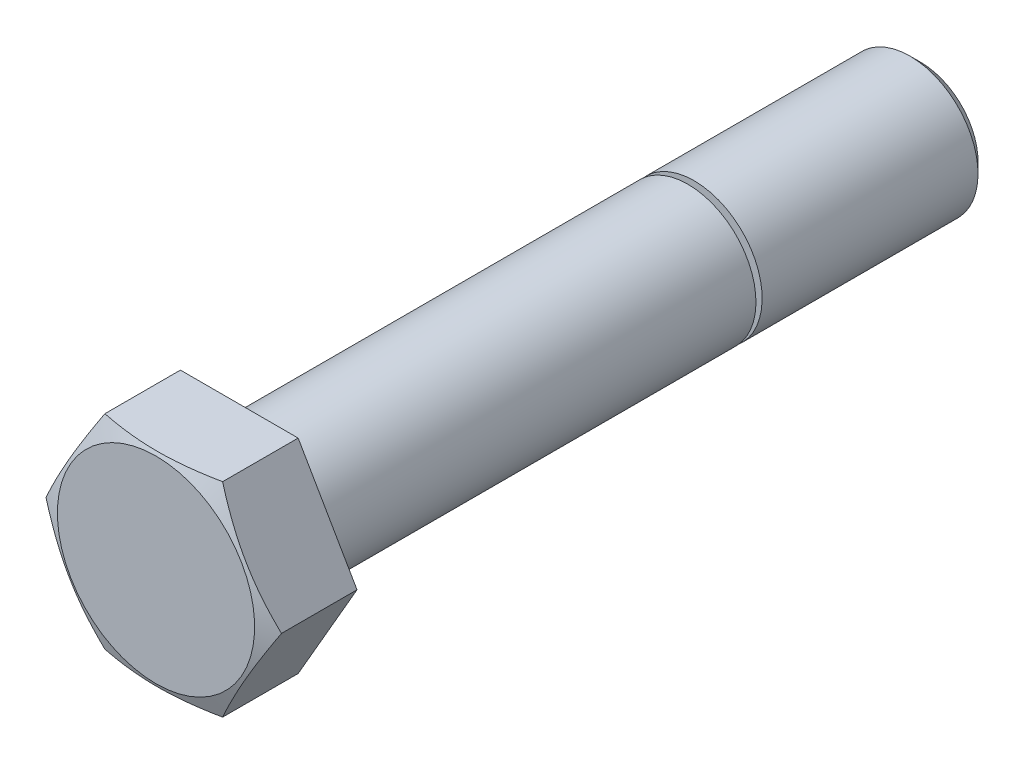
ISO-10303-21;
HEADER;
FILE_DESCRIPTION(('STEP AP214'),'2;1');
FILE_NAME('part.step','',(''),(''),'','','');
FILE_SCHEMA(('AUTOMOTIVE_DESIGN { 1 0 10303 214 1 1 1 1 }'));
ENDSEC;
DATA;
#1=APPLICATION_CONTEXT('core data for automotive mechanical design processes');
#2=APPLICATION_PROTOCOL_DEFINITION('international standard','automotive_design',2000,#1);
#3=PRODUCT_CONTEXT('',#1,'mechanical');
#4=PRODUCT('Part','Part','',(#3));
#5=PRODUCT_RELATED_PRODUCT_CATEGORY('part','',(#4));
#6=PRODUCT_DEFINITION_FORMATION('','',#4);
#7=PRODUCT_DEFINITION_CONTEXT('part definition',#1,'design');
#8=PRODUCT_DEFINITION('design','',#6,#7);
#9=PRODUCT_DEFINITION_SHAPE('','',#8);
#10=(LENGTH_UNIT() NAMED_UNIT(*) SI_UNIT(.MILLI.,.METRE.));
#11=(NAMED_UNIT(*) PLANE_ANGLE_UNIT() SI_UNIT($,.RADIAN.));
#12=(NAMED_UNIT(*) SI_UNIT($,.STERADIAN.) SOLID_ANGLE_UNIT());
#13=UNCERTAINTY_MEASURE_WITH_UNIT(LENGTH_MEASURE(1.E-05),#10,'distance_accuracy_value','');
#14=(GEOMETRIC_REPRESENTATION_CONTEXT(3) GLOBAL_UNCERTAINTY_ASSIGNED_CONTEXT((#13)) GLOBAL_UNIT_ASSIGNED_CONTEXT((#10,
#11,#12)) REPRESENTATION_CONTEXT('',''));
#15=CARTESIAN_POINT('',(0.,0.,0.));
#16=DIRECTION('',(0.,0.,1.));
#17=DIRECTION('',(1.,0.,0.));
#18=AXIS2_PLACEMENT_3D('',#15,#16,#17);
#19=CARTESIAN_POINT('',(0.,2.52640625,-60.));
#20=DIRECTION('',(0.,0.,-1.));
#21=DIRECTION('',(0.,1.,0.));
#22=AXIS2_PLACEMENT_3D('',#19,#20,#21);
#23=PLANE('',#22);
#24=CARTESIAN_POINT('',(0.,0.,-60.));
#25=DIRECTION('',(0.,0.,-1.));
#26=DIRECTION('',(0.,1.,0.));
#27=AXIS2_PLACEMENT_3D('',#24,#25,#26);
#28=CIRCLE('',#27,5.0528125);
#29=CARTESIAN_POINT('',(0.,5.0528125,-60.));
#30=VERTEX_POINT('',#29);
#31=EDGE_CURVE('E12',#30,#30,#28,.T.);
#32=ORIENTED_EDGE('',*,*,#31,.T.);
#33=EDGE_LOOP('',(#32));
#34=FACE_BOUND('',#33,.T.);
#35=ADVANCED_FACE('F37',(#34),#23,.T.);
#36=CARTESIAN_POINT('',(0.,0.,-59.52640625));
#37=DIRECTION('',(0.,0.,1.));
#38=DIRECTION('',(0.,1.,0.));
#39=AXIS2_PLACEMENT_3D('',#36,#37,#38);
#40=CONICAL_SURFACE('',#39,5.52640625,0.785398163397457);
#41=CARTESIAN_POINT('',(0.,0.,-59.0528125));
#42=DIRECTION('',(0.,0.,-1.));
#43=DIRECTION('',(0.,1.,0.));
#44=AXIS2_PLACEMENT_3D('',#41,#42,#43);
#45=CIRCLE('',#44,6.);
#46=CARTESIAN_POINT('',(0.,6.,-59.0528125));
#47=VERTEX_POINT('',#46);
#48=EDGE_CURVE('E46',#47,#47,#45,.T.);
#49=ORIENTED_EDGE('',*,*,#48,.T.);
#50=EDGE_LOOP('',(#49));
#51=FACE_BOUND('',#50,.T.);
#52=ORIENTED_EDGE('',*,*,#31,.F.);
#53=EDGE_LOOP('',(#52));
#54=FACE_BOUND('',#53,.T.);
#55=ADVANCED_FACE('F222',(#51,#54),#40,.T.);
#56=CARTESIAN_POINT('',(0.,0.,-44.52640625));
#57=DIRECTION('',(0.,0.,1.));
#58=DIRECTION('',(0.,1.,0.));
#59=AXIS2_PLACEMENT_3D('',#56,#57,#58);
#60=CYLINDRICAL_SURFACE('',#59,6.);
#61=CARTESIAN_POINT('',(0.,0.,-40.));
#62=DIRECTION('',(0.,0.,1.));
#63=DIRECTION('',(1.,0.,0.));
#64=AXIS2_PLACEMENT_3D('',#61,#62,#63);
#65=CIRCLE('',#64,6.);
#66=CARTESIAN_POINT('',(0.,6.,-40.));
#67=VERTEX_POINT('',#66);
#68=EDGE_CURVE('E40',#67,#67,#65,.F.);
#69=ORIENTED_EDGE('',*,*,#68,.T.);
#70=EDGE_LOOP('',(#69));
#71=FACE_BOUND('',#70,.T.);
#72=ORIENTED_EDGE('',*,*,#48,.F.);
#73=EDGE_LOOP('',(#72));
#74=FACE_BOUND('',#73,.T.);
#75=ADVANCED_FACE('F206',(#71,#74),#60,.T.);
#76=CARTESIAN_POINT('',(0.,5.52640625,-40.));
#77=DIRECTION('',(0.,0.,1.));
#78=DIRECTION('',(0.,-1.,0.));
#79=AXIS2_PLACEMENT_3D('',#76,#77,#78);
#80=PLANE('',#79);
#81=CARTESIAN_POINT('',(0.,0.,-40.));
#82=DIRECTION('',(0.,0.,-1.));
#83=DIRECTION('',(0.,1.,0.));
#84=AXIS2_PLACEMENT_3D('',#81,#82,#83);
#85=CIRCLE('',#84,5.0528125);
#86=CARTESIAN_POINT('',(0.,5.0528125,-40.));
#87=VERTEX_POINT('',#86);
#88=EDGE_CURVE('E180',#87,#87,#85,.T.);
#89=ORIENTED_EDGE('',*,*,#88,.T.);
#90=EDGE_LOOP('',(#89));
#91=FACE_BOUND('',#90,.T.);
#92=ORIENTED_EDGE('',*,*,#68,.F.);
#93=EDGE_LOOP('',(#92));
#94=FACE_BOUND('',#93,.T.);
#95=ADVANCED_FACE('F209',(#91,#94),#80,.T.);
#96=CARTESIAN_POINT('',(0.,0.,-39.726570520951));
#97=DIRECTION('',(0.,0.,1.));
#98=DIRECTION('',(0.,1.,0.));
#99=AXIS2_PLACEMENT_3D('',#96,#97,#98);
#100=CONICAL_SURFACE('',#99,5.52640625,1.0471975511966);
#101=CARTESIAN_POINT('',(0.,0.,-39.4531410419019));
#102=DIRECTION('',(0.,0.,-1.));
#103=DIRECTION('',(0.,1.,0.));
#104=AXIS2_PLACEMENT_3D('',#101,#102,#103);
#105=CIRCLE('',#104,6.);
#106=CARTESIAN_POINT('',(0.,6.,-39.4531410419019));
#107=VERTEX_POINT('',#106);
#108=EDGE_CURVE('E149',#107,#107,#105,.T.);
#109=ORIENTED_EDGE('',*,*,#108,.T.);
#110=EDGE_LOOP('',(#109));
#111=FACE_BOUND('',#110,.T.);
#112=ORIENTED_EDGE('',*,*,#88,.F.);
#113=EDGE_LOOP('',(#112));
#114=FACE_BOUND('',#113,.T.);
#115=ADVANCED_FACE('F211',(#111,#114),#100,.T.);
#116=CARTESIAN_POINT('',(0.,0.,-20.026570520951));
#117=DIRECTION('',(0.,0.,1.));
#118=DIRECTION('',(0.,1.,0.));
#119=AXIS2_PLACEMENT_3D('',#116,#117,#118);
#120=CYLINDRICAL_SURFACE('',#119,6.);
#121=CARTESIAN_POINT('',(0.,0.,-0.6));
#122=DIRECTION('',(0.,0.,-1.));
#123=DIRECTION('',(0.,1.,0.));
#124=AXIS2_PLACEMENT_3D('',#121,#122,#123);
#125=CIRCLE('',#124,6.);
#126=CARTESIAN_POINT('',(0.,6.,-0.6));
#127=VERTEX_POINT('',#126);
#128=EDGE_CURVE('E118',#127,#127,#125,.T.);
#129=ORIENTED_EDGE('',*,*,#128,.T.);
#130=EDGE_LOOP('',(#129));
#131=FACE_BOUND('',#130,.T.);
#132=ORIENTED_EDGE('',*,*,#108,.F.);
#133=EDGE_LOOP('',(#132));
#134=FACE_BOUND('',#133,.T.);
#135=ADVANCED_FACE('F218',(#131,#134),#120,.T.);
#136=CARTESIAN_POINT('',(0.,0.,-0.6));
#137=DIRECTION('',(0.,0.,-1.));
#138=DIRECTION('',(-1.,0.,0.));
#139=AXIS2_PLACEMENT_3D('',#136,#137,#138);
#140=TOROIDAL_SURFACE('',#139,6.6,0.6);
#141=CARTESIAN_POINT('',(0.,0.,0.));
#142=DIRECTION('',(0.,0.,-1.));
#143=DIRECTION('',(0.,1.,0.));
#144=AXIS2_PLACEMENT_3D('',#141,#142,#143);
#145=CIRCLE('',#144,6.6);
#146=CARTESIAN_POINT('',(0.,6.6,0.));
#147=VERTEX_POINT('',#146);
#148=EDGE_CURVE('E115',#147,#147,#145,.T.);
#149=ORIENTED_EDGE('',*,*,#148,.T.);
#150=EDGE_LOOP('',(#149));
#151=FACE_BOUND('',#150,.T.);
#152=ORIENTED_EDGE('',*,*,#128,.F.);
#153=EDGE_LOOP('',(#152));
#154=FACE_BOUND('',#153,.T.);
#155=ADVANCED_FACE('F264',(#151,#154),#140,.F.);
#156=CARTESIAN_POINT('',(0.,7.4575,0.));
#157=DIRECTION('',(0.,0.,-1.));
#158=DIRECTION('',(0.,1.,0.));
#159=AXIS2_PLACEMENT_3D('',#156,#157,#158);
#160=PLANE('',#159);
#161=CARTESIAN_POINT('',(0.,0.,0.));
#162=DIRECTION('',(0.,0.,-1.));
#163=DIRECTION('',(0.,1.,0.));
#164=AXIS2_PLACEMENT_3D('',#161,#162,#163);
#165=CIRCLE('',#164,8.315);
#166=CARTESIAN_POINT('',(0.,8.315,0.));
#167=VERTEX_POINT('',#166);
#168=EDGE_CURVE('E111',#167,#167,#165,.T.);
#169=ORIENTED_EDGE('',*,*,#168,.T.);
#170=EDGE_LOOP('',(#169));
#171=FACE_BOUND('',#170,.T.);
#172=ORIENTED_EDGE('',*,*,#148,.F.);
#173=EDGE_LOOP('',(#172));
#174=FACE_BOUND('',#173,.T.);
#175=ADVANCED_FACE('F112',(#171,#174),#160,.T.);
#176=CARTESIAN_POINT('',(0.,0.,0.15));
#177=DIRECTION('',(0.,0.,-1.));
#178=DIRECTION('',(-1.,0.,0.));
#179=AXIS2_PLACEMENT_3D('',#176,#177,#178);
#180=TOROIDAL_SURFACE('',#179,8.315,0.15);
#181=CARTESIAN_POINT('',(0.,0.,0.15));
#182=DIRECTION('',(0.,0.,-1.));
#183=DIRECTION('',(0.,1.,0.));
#184=AXIS2_PLACEMENT_3D('',#181,#182,#183);
#185=CIRCLE('',#184,8.465);
#186=CARTESIAN_POINT('',(0.,8.465,0.15));
#187=VERTEX_POINT('',#186);
#188=EDGE_CURVE('E116',#187,#187,#185,.T.);
#189=ORIENTED_EDGE('',*,*,#188,.T.);
#190=EDGE_LOOP('',(#189));
#191=FACE_BOUND('',#190,.T.);
#192=ORIENTED_EDGE('',*,*,#168,.F.);
#193=EDGE_LOOP('',(#192));
#194=FACE_BOUND('',#193,.T.);
#195=ADVANCED_FACE('F240',(#191,#194),#180,.T.);
#196=CARTESIAN_POINT('',(0.,9.42865,0.15));
#197=DIRECTION('',(0.,0.,-1.));
#198=DIRECTION('',(0.,1.,0.));
#199=AXIS2_PLACEMENT_3D('',#196,#197,#198);
#200=PLANE('',#199);
#201=ORIENTED_EDGE('',*,*,#188,.F.);
#202=EDGE_LOOP('',(#201));
#203=FACE_BOUND('',#202,.T.);
#204=DIRECTION('',(0.5,-0.866025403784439,0.));
#205=VECTOR('',#204,1.);
#206=CARTESIAN_POINT('',(-9.83558760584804,-0.964254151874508,0.149999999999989));
#207=LINE('',#206,#205);
#208=CARTESIAN_POINT('',(-10.3923,0.,0.15));
#209=VERTEX_POINT('',#208);
#210=CARTESIAN_POINT('',(-5.19615,-8.99999580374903,0.15));
#211=VERTEX_POINT('',#210);
#212=EDGE_CURVE('E179',#209,#211,#207,.T.);
#213=ORIENTED_EDGE('',*,*,#212,.F.);
#214=DIRECTION('',(-0.5,-0.866025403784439,0.));
#215=VECTOR('',#214,1.);
#216=CARTESIAN_POINT('',(-5.75286239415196,8.03574165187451,0.149999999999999));
#217=LINE('',#216,#215);
#218=CARTESIAN_POINT('',(-5.19615,8.99999580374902,0.15));
#219=VERTEX_POINT('',#218);
#220=EDGE_CURVE('E145',#219,#209,#217,.T.);
#221=ORIENTED_EDGE('',*,*,#220,.F.);
#222=DIRECTION('',(-1.,0.,0.));
#223=VECTOR('',#222,1.);
#224=CARTESIAN_POINT('',(0.,8.99999580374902,0.15));
#225=LINE('',#224,#223);
#226=CARTESIAN_POINT('',(5.19615,8.99999580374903,0.15));
#227=VERTEX_POINT('',#226);
#228=EDGE_CURVE('E126',#227,#219,#225,.T.);
#229=ORIENTED_EDGE('',*,*,#228,.F.);
#230=DIRECTION('',(-0.5,0.866025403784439,0.));
#231=VECTOR('',#230,1.);
#232=CARTESIAN_POINT('',(5.75286239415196,8.03574165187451,0.149999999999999));
#233=LINE('',#232,#231);
#234=CARTESIAN_POINT('',(10.3923,0.,0.15));
#235=VERTEX_POINT('',#234);
#236=EDGE_CURVE('E157',#235,#227,#233,.T.);
#237=ORIENTED_EDGE('',*,*,#236,.F.);
#238=DIRECTION('',(0.5,0.866025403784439,0.));
#239=VECTOR('',#238,1.);
#240=CARTESIAN_POINT('',(9.83558760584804,-0.964254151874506,0.149999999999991));
#241=LINE('',#240,#239);
#242=CARTESIAN_POINT('',(5.19615,-8.99999580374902,0.15));
#243=VERTEX_POINT('',#242);
#244=EDGE_CURVE('E150',#243,#235,#241,.T.);
#245=ORIENTED_EDGE('',*,*,#244,.F.);
#246=DIRECTION('',(1.,0.,0.));
#247=VECTOR('',#246,1.);
#248=CARTESIAN_POINT('',(0.,-8.99999580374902,0.149999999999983));
#249=LINE('',#248,#247);
#250=EDGE_CURVE('E189',#211,#243,#249,.T.);
#251=ORIENTED_EDGE('',*,*,#250,.F.);
#252=EDGE_LOOP('',(#213,#221,#229,#237,#245,#251));
#253=FACE_BOUND('',#252,.T.);
#254=ADVANCED_FACE('F243',(#203,#253),#200,.T.);
#255=CARTESIAN_POINT('',(0.,0.,7.15909090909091));
#256=DIRECTION('',(0.,0.,-1.));
#257=DIRECTION('',(0.,1.,0.));
#258=AXIS2_PLACEMENT_3D('',#255,#256,#257);
#259=CONICAL_SURFACE('',#258,9.54852039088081,1.18682389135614);
#260=CARTESIAN_POINT('',(0.,0.,7.5));
#261=DIRECTION('',(0.,0.,-1.));
#262=DIRECTION('',(0.,1.,0.));
#263=AXIS2_PLACEMENT_3D('',#260,#261,#262);
#264=CIRCLE('',#263,8.70474078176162);
#265=CARTESIAN_POINT('',(0.,8.70474078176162,7.5));
#266=VERTEX_POINT('',#265);
#267=EDGE_CURVE('E120',#266,#266,#264,.T.);
#268=ORIENTED_EDGE('',*,*,#267,.T.);
#269=EDGE_LOOP('',(#268));
#270=FACE_BOUND('',#269,.T.);
#271=CARTESIAN_POINT('',(5.19615,-8.99999580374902,6.81818181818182));
#272=CARTESIAN_POINT('',(0.,-8.99999580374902,7.8678722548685));
#273=CARTESIAN_POINT('',(-5.19615,-8.99999580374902,6.81818181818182));
#274=(BOUNDED_CURVE() B_SPLINE_CURVE(2,(#271,#272,#273),.UNSPECIFIED.,.F.,
.F.) B_SPLINE_CURVE_WITH_KNOTS((3,3),(0.,10.4530209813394),
.UNSPECIFIED.) CURVE() GEOMETRIC_REPRESENTATION_ITEM() RATIONAL_B_SPLINE_CURVE((1.,
1.15470053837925,1.)) REPRESENTATION_ITEM(''));
#275=CARTESIAN_POINT('',(5.19615,-8.99999580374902,6.81818181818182));
#276=VERTEX_POINT('',#275);
#277=CARTESIAN_POINT('',(-5.19615,-8.99999580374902,6.81818181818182));
#278=VERTEX_POINT('',#277);
#279=EDGE_CURVE('E154',#276,#278,#274,.T.);
#280=ORIENTED_EDGE('',*,*,#279,.F.);
#281=CARTESIAN_POINT('',(10.3923,0.,6.81818181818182));
#282=CARTESIAN_POINT('',(7.794225,-4.49999790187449,7.86787225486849));
#283=CARTESIAN_POINT('',(5.19615,-8.99999580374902,6.81818181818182));
#284=(BOUNDED_CURVE() B_SPLINE_CURVE(2,(#281,#282,#283),.UNSPECIFIED.,.F.,
.F.) B_SPLINE_CURVE_WITH_KNOTS((3,3),(0.,10.4530209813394),
.UNSPECIFIED.) CURVE() GEOMETRIC_REPRESENTATION_ITEM() RATIONAL_B_SPLINE_CURVE((1.,
1.15470053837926,1.)) REPRESENTATION_ITEM(''));
#285=CARTESIAN_POINT('',(10.3923,0.,6.81818181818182));
#286=VERTEX_POINT('',#285);
#287=EDGE_CURVE('E162',#286,#276,#284,.T.);
#288=ORIENTED_EDGE('',*,*,#287,.F.);
#289=CARTESIAN_POINT('',(5.19615,8.99999580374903,6.81818181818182));
#290=CARTESIAN_POINT('',(7.79422499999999,4.49999790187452,7.86787225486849));
#291=CARTESIAN_POINT('',(10.3923,0.,6.81818181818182));
#292=(BOUNDED_CURVE() B_SPLINE_CURVE(2,(#289,#290,#291),.UNSPECIFIED.,.F.,
.F.) B_SPLINE_CURVE_WITH_KNOTS((3,3),(0.,10.4530209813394),
.UNSPECIFIED.) CURVE() GEOMETRIC_REPRESENTATION_ITEM() RATIONAL_B_SPLINE_CURVE((1.,
1.15470053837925,1.)) REPRESENTATION_ITEM(''));
#293=CARTESIAN_POINT('',(5.19615,8.99999580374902,6.81818181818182));
#294=VERTEX_POINT('',#293);
#295=EDGE_CURVE('E147',#294,#286,#292,.T.);
#296=ORIENTED_EDGE('',*,*,#295,.F.);
#297=CARTESIAN_POINT('',(-5.19615,8.99999580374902,6.81818181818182));
#298=CARTESIAN_POINT('',(0.,8.99999580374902,7.8678722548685));
#299=CARTESIAN_POINT('',(5.19615,8.99999580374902,6.81818181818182));
#300=(BOUNDED_CURVE() B_SPLINE_CURVE(2,(#297,#298,#299),.UNSPECIFIED.,.F.,
.F.) B_SPLINE_CURVE_WITH_KNOTS((3,3),(0.,10.4530209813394),
.UNSPECIFIED.) CURVE() GEOMETRIC_REPRESENTATION_ITEM() RATIONAL_B_SPLINE_CURVE((1.,
1.15470053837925,1.)) REPRESENTATION_ITEM(''));
#301=CARTESIAN_POINT('',(-5.19615,8.99999580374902,6.81818181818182));
#302=VERTEX_POINT('',#301);
#303=EDGE_CURVE('E130',#302,#294,#300,.T.);
#304=ORIENTED_EDGE('',*,*,#303,.F.);
#305=CARTESIAN_POINT('',(-10.3923,0.,6.81818181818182));
#306=CARTESIAN_POINT('',(-7.794225,4.4999979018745,7.86787225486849));
#307=CARTESIAN_POINT('',(-5.19615,8.99999580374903,6.81818181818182));
#308=(BOUNDED_CURVE() B_SPLINE_CURVE(2,(#305,#306,#307),.UNSPECIFIED.,.F.,
.F.) B_SPLINE_CURVE_WITH_KNOTS((3,3),(0.,10.4530209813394),
.UNSPECIFIED.) CURVE() GEOMETRIC_REPRESENTATION_ITEM() RATIONAL_B_SPLINE_CURVE((1.,
1.15470053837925,1.)) REPRESENTATION_ITEM(''));
#309=CARTESIAN_POINT('',(-10.3923,0.,6.81818181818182));
#310=VERTEX_POINT('',#309);
#311=EDGE_CURVE('E144',#310,#302,#308,.T.);
#312=ORIENTED_EDGE('',*,*,#311,.F.);
#313=CARTESIAN_POINT('',(-5.19615,-8.99999580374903,6.81818181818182));
#314=CARTESIAN_POINT('',(-7.794225,-4.4999979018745,7.8678722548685));
#315=CARTESIAN_POINT('',(-10.3923,0.,6.81818181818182));
#316=(BOUNDED_CURVE() B_SPLINE_CURVE(2,(#313,#314,#315),.UNSPECIFIED.,.F.,
.F.) B_SPLINE_CURVE_WITH_KNOTS((3,3),(0.,10.4530209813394),
.UNSPECIFIED.) CURVE() GEOMETRIC_REPRESENTATION_ITEM() RATIONAL_B_SPLINE_CURVE((1.,
1.15470053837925,1.)) REPRESENTATION_ITEM(''));
#317=EDGE_CURVE('E185',#278,#310,#316,.T.);
#318=ORIENTED_EDGE('',*,*,#317,.F.);
#319=EDGE_LOOP('',(#280,#288,#296,#304,#312,#318));
#320=FACE_BOUND('',#319,.T.);
#321=ADVANCED_FACE('F303',(#270,#320),#259,.T.);
#322=CARTESIAN_POINT('',(0.,4.35237039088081,7.5));
#323=DIRECTION('',(0.,0.,1.));
#324=DIRECTION('',(0.,-1.,0.));
#325=AXIS2_PLACEMENT_3D('',#322,#323,#324);
#326=PLANE('',#325);
#327=ORIENTED_EDGE('',*,*,#267,.F.);
#328=EDGE_LOOP('',(#327));
#329=FACE_BOUND('',#328,.T.);
#330=ADVANCED_FACE('F249',(#329),#326,.T.);
#331=CARTESIAN_POINT('',(7.794225,4.49999790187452,7.5));
#332=DIRECTION('',(0.866025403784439,0.5,0.));
#333=DIRECTION('',(0.5,-0.866025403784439,0.));
#334=AXIS2_PLACEMENT_3D('',#331,#332,#333);
#335=PLANE('',#334);
#336=ORIENTED_EDGE('',*,*,#236,.T.);
#337=DIRECTION('',(0.,0.,1.));
#338=VECTOR('',#337,1.);
#339=CARTESIAN_POINT('',(5.19615,8.99999580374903,3.48409090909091));
#340=LINE('',#339,#338);
#341=EDGE_CURVE('E135',#227,#294,#340,.T.);
#342=ORIENTED_EDGE('',*,*,#341,.T.);
#343=ORIENTED_EDGE('',*,*,#295,.T.);
#344=DIRECTION('',(0.,0.,1.));
#345=VECTOR('',#344,1.);
#346=CARTESIAN_POINT('',(10.3923,0.,3.48409090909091));
#347=LINE('',#346,#345);
#348=EDGE_CURVE('E153',#235,#286,#347,.T.);
#349=ORIENTED_EDGE('',*,*,#348,.F.);
#350=EDGE_LOOP('',(#336,#342,#343,#349));
#351=FACE_BOUND('',#350,.T.);
#352=ADVANCED_FACE('F245',(#351),#335,.T.);
#353=CARTESIAN_POINT('',(7.794225,-4.49999790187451,7.5));
#354=DIRECTION('',(0.866025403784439,-0.5,0.));
#355=DIRECTION('',(-0.5,-0.866025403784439,0.));
#356=AXIS2_PLACEMENT_3D('',#353,#354,#355);
#357=PLANE('',#356);
#358=ORIENTED_EDGE('',*,*,#244,.T.);
#359=ORIENTED_EDGE('',*,*,#348,.T.);
#360=ORIENTED_EDGE('',*,*,#287,.T.);
#361=DIRECTION('',(0.,0.,1.));
#362=VECTOR('',#361,1.);
#363=CARTESIAN_POINT('',(5.19615,-8.99999580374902,3.48409090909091));
#364=LINE('',#363,#362);
#365=EDGE_CURVE('E124',#243,#276,#364,.T.);
#366=ORIENTED_EDGE('',*,*,#365,.F.);
#367=EDGE_LOOP('',(#358,#359,#360,#366));
#368=FACE_BOUND('',#367,.T.);
#369=ADVANCED_FACE('F248',(#368),#357,.T.);
#370=CARTESIAN_POINT('',(0.,-8.99999580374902,7.5));
#371=DIRECTION('',(0.,-1.,0.));
#372=DIRECTION('',(-1.,0.,0.));
#373=AXIS2_PLACEMENT_3D('',#370,#371,#372);
#374=PLANE('',#373);
#375=ORIENTED_EDGE('',*,*,#250,.T.);
#376=ORIENTED_EDGE('',*,*,#365,.T.);
#377=ORIENTED_EDGE('',*,*,#279,.T.);
#378=DIRECTION('',(0.,0.,1.));
#379=VECTOR('',#378,1.);
#380=CARTESIAN_POINT('',(-5.19615,-8.99999580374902,3.48409090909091));
#381=LINE('',#380,#379);
#382=EDGE_CURVE('E190',#211,#278,#381,.T.);
#383=ORIENTED_EDGE('',*,*,#382,.F.);
#384=EDGE_LOOP('',(#375,#376,#377,#383));
#385=FACE_BOUND('',#384,.T.);
#386=ADVANCED_FACE('F238',(#385),#374,.T.);
#387=CARTESIAN_POINT('',(-7.794225,-4.49999790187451,7.5));
#388=DIRECTION('',(-0.866025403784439,-0.5,0.));
#389=DIRECTION('',(-0.5,0.866025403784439,0.));
#390=AXIS2_PLACEMENT_3D('',#387,#388,#389);
#391=PLANE('',#390);
#392=ORIENTED_EDGE('',*,*,#212,.T.);
#393=ORIENTED_EDGE('',*,*,#382,.T.);
#394=ORIENTED_EDGE('',*,*,#317,.T.);
#395=DIRECTION('',(0.,0.,-1.));
#396=VECTOR('',#395,1.);
#397=CARTESIAN_POINT('',(-10.3923,0.,3.48409090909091));
#398=LINE('',#397,#396);
#399=EDGE_CURVE('E141',#310,#209,#398,.T.);
#400=ORIENTED_EDGE('',*,*,#399,.T.);
#401=EDGE_LOOP('',(#392,#393,#394,#400));
#402=FACE_BOUND('',#401,.T.);
#403=ADVANCED_FACE('F234',(#402),#391,.T.);
#404=CARTESIAN_POINT('',(-7.794225,4.49999790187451,7.5));
#405=DIRECTION('',(-0.866025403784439,0.5,0.));
#406=DIRECTION('',(0.5,0.866025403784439,0.));
#407=AXIS2_PLACEMENT_3D('',#404,#405,#406);
#408=PLANE('',#407);
#409=ORIENTED_EDGE('',*,*,#220,.T.);
#410=ORIENTED_EDGE('',*,*,#399,.F.);
#411=ORIENTED_EDGE('',*,*,#311,.T.);
#412=DIRECTION('',(0.,0.,1.));
#413=VECTOR('',#412,1.);
#414=CARTESIAN_POINT('',(-5.19615,8.99999580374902,3.48409090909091));
#415=LINE('',#414,#413);
#416=EDGE_CURVE('E129',#219,#302,#415,.T.);
#417=ORIENTED_EDGE('',*,*,#416,.F.);
#418=EDGE_LOOP('',(#409,#410,#411,#417));
#419=FACE_BOUND('',#418,.T.);
#420=ADVANCED_FACE('F237',(#419),#408,.T.);
#421=CARTESIAN_POINT('',(0.,8.99999580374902,7.5));
#422=DIRECTION('',(0.,1.,0.));
#423=DIRECTION('',(1.,0.,0.));
#424=AXIS2_PLACEMENT_3D('',#421,#422,#423);
#425=PLANE('',#424);
#426=ORIENTED_EDGE('',*,*,#228,.T.);
#427=ORIENTED_EDGE('',*,*,#416,.T.);
#428=ORIENTED_EDGE('',*,*,#303,.T.);
#429=ORIENTED_EDGE('',*,*,#341,.F.);
#430=EDGE_LOOP('',(#426,#427,#428,#429));
#431=FACE_BOUND('',#430,.T.);
#432=ADVANCED_FACE('F256',(#431),#425,.T.);
#433=CLOSED_SHELL('',(#35,#55,#75,#95,#115,#135,#155,#175,#195,#254,#321,#330,#352,#369,#386,
#403,#420,#432));
#434=MANIFOLD_SOLID_BREP('B2',#433);
#435=ADVANCED_BREP_SHAPE_REPRESENTATION('',(#18,#434),#14);
#436=SHAPE_DEFINITION_REPRESENTATION(#9,#435);
ENDSEC;
END-ISO-10303-21;
